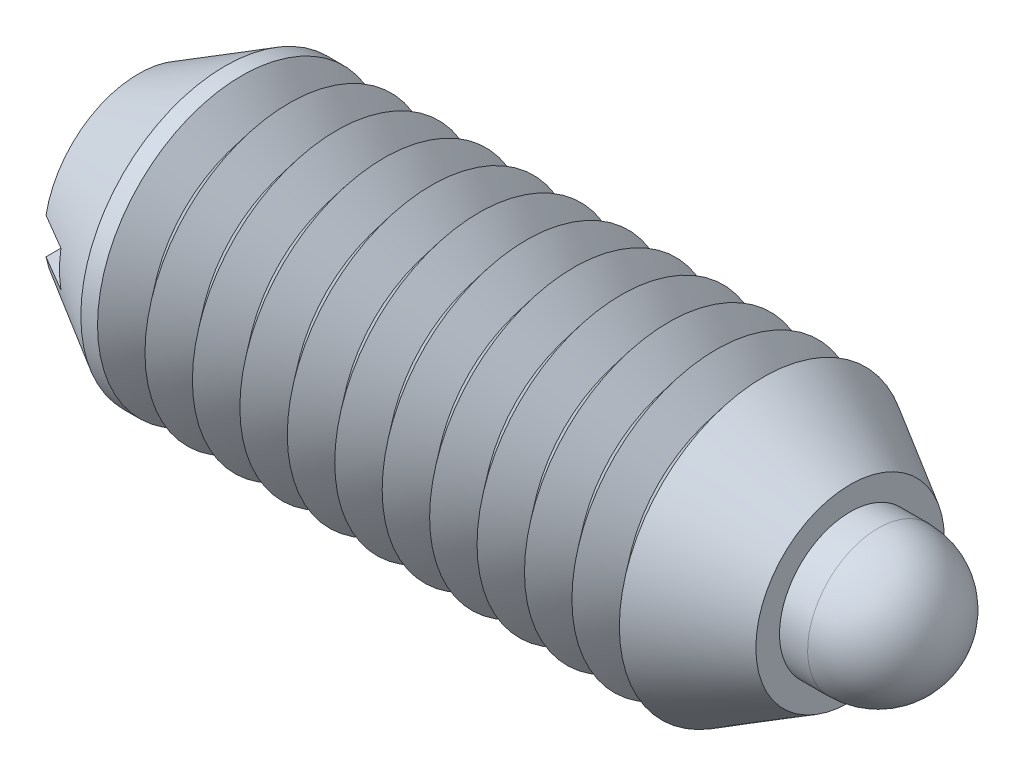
ISO-10303-21;
HEADER;
FILE_DESCRIPTION(('STEP AP214'),'2;1');
FILE_NAME('part.step','',(''),(''),'','','');
FILE_SCHEMA(('AUTOMOTIVE_DESIGN { 1 0 10303 214 1 1 1 1 }'));
ENDSEC;
DATA;
#1=APPLICATION_CONTEXT('core data for automotive mechanical design processes');
#2=APPLICATION_PROTOCOL_DEFINITION('international standard','automotive_design',2000,#1);
#3=PRODUCT_CONTEXT('',#1,'mechanical');
#4=PRODUCT('Part','Part','',(#3));
#5=PRODUCT_RELATED_PRODUCT_CATEGORY('part','',(#4));
#6=PRODUCT_DEFINITION_FORMATION('','',#4);
#7=PRODUCT_DEFINITION_CONTEXT('part definition',#1,'design');
#8=PRODUCT_DEFINITION('design','',#6,#7);
#9=PRODUCT_DEFINITION_SHAPE('','',#8);
#10=(LENGTH_UNIT() NAMED_UNIT(*) SI_UNIT(.MILLI.,.METRE.));
#11=(NAMED_UNIT(*) PLANE_ANGLE_UNIT() SI_UNIT($,.RADIAN.));
#12=(NAMED_UNIT(*) SI_UNIT($,.STERADIAN.) SOLID_ANGLE_UNIT());
#13=UNCERTAINTY_MEASURE_WITH_UNIT(LENGTH_MEASURE(1.E-05),#10,'distance_accuracy_value','');
#14=(GEOMETRIC_REPRESENTATION_CONTEXT(3) GLOBAL_UNCERTAINTY_ASSIGNED_CONTEXT((#13)) GLOBAL_UNIT_ASSIGNED_CONTEXT((#10,
#11,#12)) REPRESENTATION_CONTEXT('',''));
#15=CARTESIAN_POINT('',(0.,0.,0.));
#16=DIRECTION('',(0.,0.,1.));
#17=DIRECTION('',(1.,0.,0.));
#18=AXIS2_PLACEMENT_3D('',#15,#16,#17);
#19=CARTESIAN_POINT('',(9.18972,0.,0.));
#20=DIRECTION('',(-1.,0.,0.));
#21=DIRECTION('',(0.,-0.719424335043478,-0.694570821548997));
#22=AXIS2_PLACEMENT_3D('',#19,#20,#21);
#23=PLANE('',#22);
#24=CARTESIAN_POINT('',(9.18972,0.,0.));
#25=DIRECTION('',(1.,0.,0.));
#26=DIRECTION('',(0.,0.719424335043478,0.694570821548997));
#27=AXIS2_PLACEMENT_3D('',#24,#25,#26);
#28=CIRCLE('',#27,1.1811);
#29=CARTESIAN_POINT('',(9.18972,0.849712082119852,0.82035759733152));
#30=VERTEX_POINT('',#29);
#31=EDGE_CURVE('P0_E10',#30,#30,#28,.T.);
#32=ORIENTED_EDGE('',*,*,#31,.F.);
#33=EDGE_LOOP('',(#32));
#34=FACE_BOUND('',#33,.T.);
#35=ADVANCED_FACE('P0_F14',(#34),#23,.T.);
#36=CARTESIAN_POINT('',(9.42594,0.,0.));
#37=DIRECTION('',(1.,0.,0.));
#38=DIRECTION('',(0.,0.719424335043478,0.694570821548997));
#39=AXIS2_PLACEMENT_3D('',#36,#37,#38);
#40=CONICAL_SURFACE('',#39,1.41732,0.785398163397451);
#41=ORIENTED_EDGE('',*,*,#31,.T.);
#42=EDGE_LOOP('',(#41));
#43=FACE_BOUND('',#42,.T.);
#44=CARTESIAN_POINT('',(9.42594,0.,0.));
#45=DIRECTION('',(1.,0.,0.));
#46=DIRECTION('',(0.,0.719424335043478,0.694570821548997));
#47=AXIS2_PLACEMENT_3D('',#44,#45,#46);
#48=CIRCLE('',#47,1.41732);
#49=CARTESIAN_POINT('',(9.42594,1.01965449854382,0.984429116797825));
#50=VERTEX_POINT('',#49);
#51=EDGE_CURVE('P0_E20',#50,#50,#48,.T.);
#52=ORIENTED_EDGE('',*,*,#51,.F.);
#53=EDGE_LOOP('',(#52));
#54=FACE_BOUND('',#53,.T.);
#55=ADVANCED_FACE('P0_F54',(#43,#54),#40,.T.);
#56=CARTESIAN_POINT('',(13.55725,0.,0.));
#57=DIRECTION('',(1.,0.,0.));
#58=DIRECTION('',(0.,0.719424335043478,0.694570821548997));
#59=AXIS2_PLACEMENT_3D('',#56,#57,#58);
#60=CYLINDRICAL_SURFACE('',#59,1.41732);
#61=ORIENTED_EDGE('',*,*,#51,.T.);
#62=EDGE_LOOP('',(#61));
#63=FACE_BOUND('',#62,.T.);
#64=CARTESIAN_POINT('',(11.1427749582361,0.,0.));
#65=DIRECTION('',(1.,0.,0.));
#66=DIRECTION('',(0.,0.719424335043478,0.694570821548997));
#67=AXIS2_PLACEMENT_3D('',#64,#65,#66);
#68=CIRCLE('',#67,1.41732);
#69=CARTESIAN_POINT('',(11.1427749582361,1.01965449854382,0.984429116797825));
#70=VERTEX_POINT('',#69);
#71=EDGE_CURVE('P0_E24',#70,#70,#68,.T.);
#72=ORIENTED_EDGE('',*,*,#71,.F.);
#73=EDGE_LOOP('',(#72));
#74=FACE_BOUND('',#73,.T.);
#75=ADVANCED_FACE('P0_F50',(#63,#74),#60,.T.);
#76=CARTESIAN_POINT('',(11.55192,0.,0.));
#77=DIRECTION('',(-1.,0.,0.));
#78=DIRECTION('',(0.,-0.719424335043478,-0.694570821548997));
#79=AXIS2_PLACEMENT_3D('',#76,#77,#78);
#80=CONICAL_SURFACE('',#79,1.1811,0.523598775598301);
#81=ORIENTED_EDGE('',*,*,#71,.T.);
#82=EDGE_LOOP('',(#81));
#83=FACE_BOUND('',#82,.T.);
#84=CARTESIAN_POINT('',(11.55192,0.,0.));
#85=DIRECTION('',(1.,0.,0.));
#86=DIRECTION('',(0.,0.719424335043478,0.694570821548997));
#87=AXIS2_PLACEMENT_3D('',#84,#85,#86);
#88=CIRCLE('',#87,1.1811);
#89=CARTESIAN_POINT('',(11.55192,0.849712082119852,0.820357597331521));
#90=VERTEX_POINT('',#89);
#91=EDGE_CURVE('P0_E28',#90,#90,#88,.T.);
#92=ORIENTED_EDGE('',*,*,#91,.F.);
#93=EDGE_LOOP('',(#92));
#94=FACE_BOUND('',#93,.T.);
#95=ADVANCED_FACE('P0_F41',(#83,#94),#80,.T.);
#96=CARTESIAN_POINT('',(13.55725,0.,0.));
#97=DIRECTION('',(1.,0.,0.));
#98=DIRECTION('',(0.,0.719424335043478,0.694570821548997));
#99=AXIS2_PLACEMENT_3D('',#96,#97,#98);
#100=CYLINDRICAL_SURFACE('',#99,1.1811);
#101=ORIENTED_EDGE('',*,*,#91,.T.);
#102=EDGE_LOOP('',(#101));
#103=FACE_BOUND('',#102,.T.);
#104=CARTESIAN_POINT('',(12.37615,0.,0.));
#105=DIRECTION('',(1.,0.,0.));
#106=DIRECTION('',(0.,0.719424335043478,0.694570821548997));
#107=AXIS2_PLACEMENT_3D('',#104,#105,#106);
#108=CIRCLE('',#107,1.1811);
#109=CARTESIAN_POINT('',(12.37615,0.849712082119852,0.820357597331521));
#110=VERTEX_POINT('',#109);
#111=EDGE_CURVE('P0_E33',#110,#110,#108,.T.);
#112=ORIENTED_EDGE('',*,*,#111,.F.);
#113=EDGE_LOOP('',(#112));
#114=FACE_BOUND('',#113,.T.);
#115=ADVANCED_FACE('P0_F39',(#103,#114),#100,.T.);
#116=CARTESIAN_POINT('',(12.37615,0.,0.));
#117=DIRECTION('',(1.,0.,0.));
#118=DIRECTION('',(0.,-0.719424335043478,-0.694570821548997));
#119=AXIS2_PLACEMENT_3D('',#116,#117,#118);
#120=SPHERICAL_SURFACE('',#119,1.1811);
#121=ORIENTED_EDGE('',*,*,#111,.T.);
#122=EDGE_LOOP('',(#121));
#123=FACE_BOUND('',#122,.T.);
#124=ADVANCED_FACE('P0_F37',(#123),#120,.T.);
#125=CLOSED_SHELL('',(#35,#55,#75,#95,#115,#124));
#126=MANIFOLD_SOLID_BREP('P0_B1',#125);
#127=CARTESIAN_POINT('',(11.90625,0.,0.));
#128=DIRECTION('',(1.,0.,0.));
#129=DIRECTION('',(0.,0.,-1.));
#130=AXIS2_PLACEMENT_3D('',#127,#128,#129);
#131=PLANE('',#130);
#132=CARTESIAN_POINT('',(11.90625,0.,0.));
#133=DIRECTION('',(1.,0.,0.));
#134=DIRECTION('',(0.,0.,-1.));
#135=AXIS2_PLACEMENT_3D('',#132,#133,#134);
#136=CIRCLE('',#135,1.57711228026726);
#137=CARTESIAN_POINT('',(11.90625,0.,-1.57711228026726));
#138=VERTEX_POINT('',#137);
#139=EDGE_CURVE('P1_E81',#138,#138,#136,.T.);
#140=ORIENTED_EDGE('',*,*,#139,.T.);
#141=EDGE_LOOP('',(#140));
#142=FACE_BOUND('',#141,.T.);
#143=CARTESIAN_POINT('',(11.90625,0.,0.));
#144=DIRECTION('',(-1.,0.,0.));
#145=DIRECTION('',(0.,0.,1.));
#146=AXIS2_PLACEMENT_3D('',#143,#144,#145);
#147=CIRCLE('',#146,1.1811);
#148=CARTESIAN_POINT('',(11.90625,0.,1.1811));
#149=VERTEX_POINT('',#148);
#150=EDGE_CURVE('P1_E68',#149,#149,#147,.T.);
#151=ORIENTED_EDGE('',*,*,#150,.T.);
#152=EDGE_LOOP('',(#151));
#153=FACE_BOUND('',#152,.T.);
#154=ADVANCED_FACE('P1_F15',(#142,#153),#131,.T.);
#155=CARTESIAN_POINT('',(11.90625,0.,0.));
#156=DIRECTION('',(-1.,0.,0.));
#157=DIRECTION('',(0.,0.,1.));
#158=AXIS2_PLACEMENT_3D('',#155,#156,#157);
#159=CONICAL_SURFACE('',#158,1.57711228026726,0.523598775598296);
#160=CARTESIAN_POINT('',(10.45845,0.,0.));
#161=DIRECTION('',(-1.,0.,0.));
#162=DIRECTION('',(0.,0.,1.));
#163=AXIS2_PLACEMENT_3D('',#160,#161,#162);
#164=CIRCLE('',#163,2.413);
#165=CARTESIAN_POINT('',(10.45845,0.,2.413));
#166=VERTEX_POINT('',#165);
#167=EDGE_CURVE('P1_E187',#166,#166,#164,.T.);
#168=ORIENTED_EDGE('',*,*,#167,.F.);
#169=EDGE_LOOP('',(#168));
#170=FACE_BOUND('',#169,.T.);
#171=ORIENTED_EDGE('',*,*,#139,.F.);
#172=EDGE_LOOP('',(#171));
#173=FACE_BOUND('',#172,.T.);
#174=ADVANCED_FACE('P1_F17',(#170,#173),#159,.T.);
#175=CARTESIAN_POINT('',(0.,0.,0.));
#176=DIRECTION('',(-1.,0.,0.));
#177=DIRECTION('',(0.,0.,1.));
#178=AXIS2_PLACEMENT_3D('',#175,#176,#177);
#179=CYLINDRICAL_SURFACE('',#178,1.1811);
#180=CARTESIAN_POINT('',(11.55192,0.,0.));
#181=DIRECTION('',(-1.,0.,0.));
#182=DIRECTION('',(0.,0.,1.));
#183=AXIS2_PLACEMENT_3D('',#180,#181,#182);
#184=CIRCLE('',#183,1.1811);
#185=CARTESIAN_POINT('',(11.55192,0.,1.1811));
#186=VERTEX_POINT('',#185);
#187=EDGE_CURVE('P1_E199',#186,#186,#184,.T.);
#188=ORIENTED_EDGE('',*,*,#187,.T.);
#189=EDGE_LOOP('',(#188));
#190=FACE_BOUND('',#189,.T.);
#191=ORIENTED_EDGE('',*,*,#150,.F.);
#192=EDGE_LOOP('',(#191));
#193=FACE_BOUND('',#192,.T.);
#194=ADVANCED_FACE('P1_F504',(#190,#193),#179,.F.);
#195=CARTESIAN_POINT('',(11.55192,0.,0.));
#196=DIRECTION('',(-1.,0.,0.));
#197=DIRECTION('',(0.,0.,1.));
#198=AXIS2_PLACEMENT_3D('',#195,#196,#197);
#199=CONICAL_SURFACE('',#198,1.1811,0.785398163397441);
#200=CARTESIAN_POINT('',(11.3157,0.,0.));
#201=DIRECTION('',(-1.,0.,0.));
#202=DIRECTION('',(0.,0.,1.));
#203=AXIS2_PLACEMENT_3D('',#200,#201,#202);
#204=CIRCLE('',#203,1.41732);
#205=CARTESIAN_POINT('',(11.3157,0.,1.41732));
#206=VERTEX_POINT('',#205);
#207=EDGE_CURVE('P1_E196',#206,#206,#204,.T.);
#208=ORIENTED_EDGE('',*,*,#207,.T.);
#209=EDGE_LOOP('',(#208));
#210=FACE_BOUND('',#209,.T.);
#211=ORIENTED_EDGE('',*,*,#187,.F.);
#212=EDGE_LOOP('',(#211));
#213=FACE_BOUND('',#212,.T.);
#214=ADVANCED_FACE('P1_F494',(#210,#213),#199,.F.);
#215=CARTESIAN_POINT('',(0.,0.,0.));
#216=DIRECTION('',(-1.,0.,0.));
#217=DIRECTION('',(0.,0.,1.));
#218=AXIS2_PLACEMENT_3D('',#215,#216,#217);
#219=CYLINDRICAL_SURFACE('',#218,1.41732);
#220=CARTESIAN_POINT('',(1.80975,0.,0.));
#221=DIRECTION('',(-1.,0.,0.));
#222=DIRECTION('',(0.,0.,1.));
#223=AXIS2_PLACEMENT_3D('',#220,#221,#222);
#224=CIRCLE('',#223,1.41732);
#225=CARTESIAN_POINT('',(1.80975,0.,1.41732));
#226=VERTEX_POINT('',#225);
#227=EDGE_CURVE('P1_E193',#226,#226,#224,.T.);
#228=ORIENTED_EDGE('',*,*,#227,.T.);
#229=EDGE_LOOP('',(#228));
#230=FACE_BOUND('',#229,.T.);
#231=ORIENTED_EDGE('',*,*,#207,.F.);
#232=EDGE_LOOP('',(#231));
#233=FACE_BOUND('',#232,.T.);
#234=ADVANCED_FACE('P1_F484',(#230,#233),#219,.F.);
#235=CARTESIAN_POINT('',(1.80975,0.,0.));
#236=DIRECTION('',(1.,0.,0.));
#237=DIRECTION('',(0.,0.,-1.));
#238=AXIS2_PLACEMENT_3D('',#235,#236,#237);
#239=PLANE('',#238);
#240=ORIENTED_EDGE('',*,*,#227,.F.);
#241=EDGE_LOOP('',(#240));
#242=FACE_BOUND('',#241,.T.);
#243=ADVANCED_FACE('P1_F474',(#242),#239,.T.);
#244=CARTESIAN_POINT('',(10.061575,0.,0.));
#245=DIRECTION('',(1.,0.,0.));
#246=DIRECTION('',(0.,0.,-1.));
#247=AXIS2_PLACEMENT_3D('',#244,#245,#246);
#248=CONICAL_SURFACE('',#247,1.91730328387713,0.895664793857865);
#249=ORIENTED_EDGE('',*,*,#167,.T.);
#250=EDGE_LOOP('',(#249));
#251=FACE_BOUND('',#250,.T.);
#252=CARTESIAN_POINT('',(10.061575,0.,0.));
#253=DIRECTION('',(-1.,0.,0.));
#254=DIRECTION('',(0.,0.,1.));
#255=AXIS2_PLACEMENT_3D('',#252,#253,#254);
#256=CIRCLE('',#255,1.91730328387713);
#257=CARTESIAN_POINT('',(10.061575,0.,1.91730328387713));
#258=VERTEX_POINT('',#257);
#259=EDGE_CURVE('P1_E190',#258,#258,#256,.T.);
#260=ORIENTED_EDGE('',*,*,#259,.F.);
#261=EDGE_LOOP('',(#260));
#262=FACE_BOUND('',#261,.T.);
#263=ADVANCED_FACE('P1_F464',(#251,#262),#248,.T.);
#264=CARTESIAN_POINT('',(9.66469999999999,0.,0.));
#265=DIRECTION('',(-1.,0.,0.));
#266=DIRECTION('',(0.,0.,1.));
#267=AXIS2_PLACEMENT_3D('',#264,#265,#266);
#268=CONICAL_SURFACE('',#267,2.413,0.895664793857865);
#269=ORIENTED_EDGE('',*,*,#259,.T.);
#270=EDGE_LOOP('',(#269));
#271=FACE_BOUND('',#270,.T.);
#272=CARTESIAN_POINT('',(9.66469999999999,0.,0.));
#273=DIRECTION('',(-1.,0.,0.));
#274=DIRECTION('',(0.,0.,1.));
#275=AXIS2_PLACEMENT_3D('',#272,#273,#274);
#276=CIRCLE('',#275,2.413);
#277=CARTESIAN_POINT('',(9.66469999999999,0.,2.413));
#278=VERTEX_POINT('',#277);
#279=EDGE_CURVE('P1_E181',#278,#278,#276,.T.);
#280=ORIENTED_EDGE('',*,*,#279,.F.);
#281=EDGE_LOOP('',(#280));
#282=FACE_BOUND('',#281,.T.);
#283=ADVANCED_FACE('P1_F454',(#271,#282),#268,.T.);
#284=CARTESIAN_POINT('',(9.26782499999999,0.,0.));
#285=DIRECTION('',(1.,0.,0.));
#286=DIRECTION('',(0.,0.,-1.));
#287=AXIS2_PLACEMENT_3D('',#284,#285,#286);
#288=CONICAL_SURFACE('',#287,1.91730328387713,0.895664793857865);
#289=ORIENTED_EDGE('',*,*,#279,.T.);
#290=EDGE_LOOP('',(#289));
#291=FACE_BOUND('',#290,.T.);
#292=CARTESIAN_POINT('',(9.26782499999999,0.,0.));
#293=DIRECTION('',(-1.,0.,0.));
#294=DIRECTION('',(0.,0.,1.));
#295=AXIS2_PLACEMENT_3D('',#292,#293,#294);
#296=CIRCLE('',#295,1.91730328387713);
#297=CARTESIAN_POINT('',(9.26782499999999,0.,1.91730328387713));
#298=VERTEX_POINT('',#297);
#299=EDGE_CURVE('P1_E184',#298,#298,#296,.T.);
#300=ORIENTED_EDGE('',*,*,#299,.F.);
#301=EDGE_LOOP('',(#300));
#302=FACE_BOUND('',#301,.T.);
#303=ADVANCED_FACE('P1_F444',(#291,#302),#288,.T.);
#304=CARTESIAN_POINT('',(8.87094999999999,0.,0.));
#305=DIRECTION('',(-1.,0.,0.));
#306=DIRECTION('',(0.,0.,1.));
#307=AXIS2_PLACEMENT_3D('',#304,#305,#306);
#308=CONICAL_SURFACE('',#307,2.413,0.895664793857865);
#309=ORIENTED_EDGE('',*,*,#299,.T.);
#310=EDGE_LOOP('',(#309));
#311=FACE_BOUND('',#310,.T.);
#312=CARTESIAN_POINT('',(8.87094999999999,0.,0.));
#313=DIRECTION('',(-1.,0.,0.));
#314=DIRECTION('',(0.,0.,1.));
#315=AXIS2_PLACEMENT_3D('',#312,#313,#314);
#316=CIRCLE('',#315,2.413);
#317=CARTESIAN_POINT('',(8.87094999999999,0.,2.413));
#318=VERTEX_POINT('',#317);
#319=EDGE_CURVE('P1_E175',#318,#318,#316,.T.);
#320=ORIENTED_EDGE('',*,*,#319,.F.);
#321=EDGE_LOOP('',(#320));
#322=FACE_BOUND('',#321,.T.);
#323=ADVANCED_FACE('P1_F434',(#311,#322),#308,.T.);
#324=CARTESIAN_POINT('',(8.47407499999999,0.,0.));
#325=DIRECTION('',(1.,0.,0.));
#326=DIRECTION('',(0.,0.,-1.));
#327=AXIS2_PLACEMENT_3D('',#324,#325,#326);
#328=CONICAL_SURFACE('',#327,1.91730328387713,0.895664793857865);
#329=ORIENTED_EDGE('',*,*,#319,.T.);
#330=EDGE_LOOP('',(#329));
#331=FACE_BOUND('',#330,.T.);
#332=CARTESIAN_POINT('',(8.47407499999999,0.,0.));
#333=DIRECTION('',(-1.,0.,0.));
#334=DIRECTION('',(0.,0.,1.));
#335=AXIS2_PLACEMENT_3D('',#332,#333,#334);
#336=CIRCLE('',#335,1.91730328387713);
#337=CARTESIAN_POINT('',(8.47407499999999,0.,1.91730328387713));
#338=VERTEX_POINT('',#337);
#339=EDGE_CURVE('P1_E178',#338,#338,#336,.T.);
#340=ORIENTED_EDGE('',*,*,#339,.F.);
#341=EDGE_LOOP('',(#340));
#342=FACE_BOUND('',#341,.T.);
#343=ADVANCED_FACE('P1_F424',(#331,#342),#328,.T.);
#344=CARTESIAN_POINT('',(8.07719999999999,0.,0.));
#345=DIRECTION('',(-1.,0.,0.));
#346=DIRECTION('',(0.,0.,1.));
#347=AXIS2_PLACEMENT_3D('',#344,#345,#346);
#348=CONICAL_SURFACE('',#347,2.413,0.895664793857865);
#349=ORIENTED_EDGE('',*,*,#339,.T.);
#350=EDGE_LOOP('',(#349));
#351=FACE_BOUND('',#350,.T.);
#352=CARTESIAN_POINT('',(8.07719999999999,0.,0.));
#353=DIRECTION('',(-1.,0.,0.));
#354=DIRECTION('',(0.,0.,1.));
#355=AXIS2_PLACEMENT_3D('',#352,#353,#354);
#356=CIRCLE('',#355,2.413);
#357=CARTESIAN_POINT('',(8.07719999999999,0.,2.413));
#358=VERTEX_POINT('',#357);
#359=EDGE_CURVE('P1_E169',#358,#358,#356,.T.);
#360=ORIENTED_EDGE('',*,*,#359,.F.);
#361=EDGE_LOOP('',(#360));
#362=FACE_BOUND('',#361,.T.);
#363=ADVANCED_FACE('P1_F414',(#351,#362),#348,.T.);
#364=CARTESIAN_POINT('',(7.68032499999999,0.,0.));
#365=DIRECTION('',(1.,0.,0.));
#366=DIRECTION('',(0.,0.,-1.));
#367=AXIS2_PLACEMENT_3D('',#364,#365,#366);
#368=CONICAL_SURFACE('',#367,1.91730328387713,0.895664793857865);
#369=ORIENTED_EDGE('',*,*,#359,.T.);
#370=EDGE_LOOP('',(#369));
#371=FACE_BOUND('',#370,.T.);
#372=CARTESIAN_POINT('',(7.68032499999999,0.,0.));
#373=DIRECTION('',(-1.,0.,0.));
#374=DIRECTION('',(0.,0.,1.));
#375=AXIS2_PLACEMENT_3D('',#372,#373,#374);
#376=CIRCLE('',#375,1.91730328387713);
#377=CARTESIAN_POINT('',(7.68032499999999,0.,1.91730328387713));
#378=VERTEX_POINT('',#377);
#379=EDGE_CURVE('P1_E172',#378,#378,#376,.T.);
#380=ORIENTED_EDGE('',*,*,#379,.F.);
#381=EDGE_LOOP('',(#380));
#382=FACE_BOUND('',#381,.T.);
#383=ADVANCED_FACE('P1_F404',(#371,#382),#368,.T.);
#384=CARTESIAN_POINT('',(7.28344999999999,0.,0.));
#385=DIRECTION('',(-1.,0.,0.));
#386=DIRECTION('',(0.,0.,1.));
#387=AXIS2_PLACEMENT_3D('',#384,#385,#386);
#388=CONICAL_SURFACE('',#387,2.413,0.895664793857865);
#389=ORIENTED_EDGE('',*,*,#379,.T.);
#390=EDGE_LOOP('',(#389));
#391=FACE_BOUND('',#390,.T.);
#392=CARTESIAN_POINT('',(7.28344999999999,0.,0.));
#393=DIRECTION('',(-1.,0.,0.));
#394=DIRECTION('',(0.,0.,1.));
#395=AXIS2_PLACEMENT_3D('',#392,#393,#394);
#396=CIRCLE('',#395,2.413);
#397=CARTESIAN_POINT('',(7.28344999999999,0.,2.413));
#398=VERTEX_POINT('',#397);
#399=EDGE_CURVE('P1_E163',#398,#398,#396,.T.);
#400=ORIENTED_EDGE('',*,*,#399,.F.);
#401=EDGE_LOOP('',(#400));
#402=FACE_BOUND('',#401,.T.);
#403=ADVANCED_FACE('P1_F394',(#391,#402),#388,.T.);
#404=CARTESIAN_POINT('',(6.88657499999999,0.,0.));
#405=DIRECTION('',(1.,0.,0.));
#406=DIRECTION('',(0.,0.,-1.));
#407=AXIS2_PLACEMENT_3D('',#404,#405,#406);
#408=CONICAL_SURFACE('',#407,1.91730328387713,0.895664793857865);
#409=ORIENTED_EDGE('',*,*,#399,.T.);
#410=EDGE_LOOP('',(#409));
#411=FACE_BOUND('',#410,.T.);
#412=CARTESIAN_POINT('',(6.88657499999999,0.,0.));
#413=DIRECTION('',(-1.,0.,0.));
#414=DIRECTION('',(0.,0.,1.));
#415=AXIS2_PLACEMENT_3D('',#412,#413,#414);
#416=CIRCLE('',#415,1.91730328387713);
#417=CARTESIAN_POINT('',(6.88657499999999,0.,1.91730328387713));
#418=VERTEX_POINT('',#417);
#419=EDGE_CURVE('P1_E166',#418,#418,#416,.T.);
#420=ORIENTED_EDGE('',*,*,#419,.F.);
#421=EDGE_LOOP('',(#420));
#422=FACE_BOUND('',#421,.T.);
#423=ADVANCED_FACE('P1_F384',(#411,#422),#408,.T.);
#424=CARTESIAN_POINT('',(6.48969999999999,0.,0.));
#425=DIRECTION('',(-1.,0.,0.));
#426=DIRECTION('',(0.,0.,1.));
#427=AXIS2_PLACEMENT_3D('',#424,#425,#426);
#428=CONICAL_SURFACE('',#427,2.413,0.895664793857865);
#429=ORIENTED_EDGE('',*,*,#419,.T.);
#430=EDGE_LOOP('',(#429));
#431=FACE_BOUND('',#430,.T.);
#432=CARTESIAN_POINT('',(6.48969999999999,0.,0.));
#433=DIRECTION('',(-1.,0.,0.));
#434=DIRECTION('',(0.,0.,1.));
#435=AXIS2_PLACEMENT_3D('',#432,#433,#434);
#436=CIRCLE('',#435,2.413);
#437=CARTESIAN_POINT('',(6.48969999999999,0.,2.413));
#438=VERTEX_POINT('',#437);
#439=EDGE_CURVE('P1_E157',#438,#438,#436,.T.);
#440=ORIENTED_EDGE('',*,*,#439,.F.);
#441=EDGE_LOOP('',(#440));
#442=FACE_BOUND('',#441,.T.);
#443=ADVANCED_FACE('P1_F374',(#431,#442),#428,.T.);
#444=CARTESIAN_POINT('',(6.09282499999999,0.,0.));
#445=DIRECTION('',(1.,0.,0.));
#446=DIRECTION('',(0.,0.,-1.));
#447=AXIS2_PLACEMENT_3D('',#444,#445,#446);
#448=CONICAL_SURFACE('',#447,1.91730328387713,0.895664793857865);
#449=ORIENTED_EDGE('',*,*,#439,.T.);
#450=EDGE_LOOP('',(#449));
#451=FACE_BOUND('',#450,.T.);
#452=CARTESIAN_POINT('',(6.09282499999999,0.,0.));
#453=DIRECTION('',(-1.,0.,0.));
#454=DIRECTION('',(0.,0.,1.));
#455=AXIS2_PLACEMENT_3D('',#452,#453,#454);
#456=CIRCLE('',#455,1.91730328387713);
#457=CARTESIAN_POINT('',(6.09282499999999,0.,1.91730328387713));
#458=VERTEX_POINT('',#457);
#459=EDGE_CURVE('P1_E160',#458,#458,#456,.T.);
#460=ORIENTED_EDGE('',*,*,#459,.F.);
#461=EDGE_LOOP('',(#460));
#462=FACE_BOUND('',#461,.T.);
#463=ADVANCED_FACE('P1_F364',(#451,#462),#448,.T.);
#464=CARTESIAN_POINT('',(5.69594999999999,0.,0.));
#465=DIRECTION('',(-1.,0.,0.));
#466=DIRECTION('',(0.,0.,1.));
#467=AXIS2_PLACEMENT_3D('',#464,#465,#466);
#468=CONICAL_SURFACE('',#467,2.413,0.895664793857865);
#469=ORIENTED_EDGE('',*,*,#459,.T.);
#470=EDGE_LOOP('',(#469));
#471=FACE_BOUND('',#470,.T.);
#472=CARTESIAN_POINT('',(5.69594999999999,0.,0.));
#473=DIRECTION('',(-1.,0.,0.));
#474=DIRECTION('',(0.,0.,1.));
#475=AXIS2_PLACEMENT_3D('',#472,#473,#474);
#476=CIRCLE('',#475,2.413);
#477=CARTESIAN_POINT('',(5.69594999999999,0.,2.413));
#478=VERTEX_POINT('',#477);
#479=EDGE_CURVE('P1_E151',#478,#478,#476,.T.);
#480=ORIENTED_EDGE('',*,*,#479,.F.);
#481=EDGE_LOOP('',(#480));
#482=FACE_BOUND('',#481,.T.);
#483=ADVANCED_FACE('P1_F354',(#471,#482),#468,.T.);
#484=CARTESIAN_POINT('',(5.29907499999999,0.,0.));
#485=DIRECTION('',(1.,0.,0.));
#486=DIRECTION('',(0.,0.,-1.));
#487=AXIS2_PLACEMENT_3D('',#484,#485,#486);
#488=CONICAL_SURFACE('',#487,1.91730328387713,0.895664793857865);
#489=ORIENTED_EDGE('',*,*,#479,.T.);
#490=EDGE_LOOP('',(#489));
#491=FACE_BOUND('',#490,.T.);
#492=CARTESIAN_POINT('',(5.29907499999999,0.,0.));
#493=DIRECTION('',(-1.,0.,0.));
#494=DIRECTION('',(0.,0.,1.));
#495=AXIS2_PLACEMENT_3D('',#492,#493,#494);
#496=CIRCLE('',#495,1.91730328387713);
#497=CARTESIAN_POINT('',(5.29907499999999,0.,1.91730328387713));
#498=VERTEX_POINT('',#497);
#499=EDGE_CURVE('P1_E154',#498,#498,#496,.T.);
#500=ORIENTED_EDGE('',*,*,#499,.F.);
#501=EDGE_LOOP('',(#500));
#502=FACE_BOUND('',#501,.T.);
#503=ADVANCED_FACE('P1_F344',(#491,#502),#488,.T.);
#504=CARTESIAN_POINT('',(4.90219999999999,0.,0.));
#505=DIRECTION('',(-1.,0.,0.));
#506=DIRECTION('',(0.,0.,1.));
#507=AXIS2_PLACEMENT_3D('',#504,#505,#506);
#508=CONICAL_SURFACE('',#507,2.413,0.895664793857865);
#509=ORIENTED_EDGE('',*,*,#499,.T.);
#510=EDGE_LOOP('',(#509));
#511=FACE_BOUND('',#510,.T.);
#512=CARTESIAN_POINT('',(4.90219999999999,0.,0.));
#513=DIRECTION('',(-1.,0.,0.));
#514=DIRECTION('',(0.,0.,1.));
#515=AXIS2_PLACEMENT_3D('',#512,#513,#514);
#516=CIRCLE('',#515,2.413);
#517=CARTESIAN_POINT('',(4.90219999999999,0.,2.413));
#518=VERTEX_POINT('',#517);
#519=EDGE_CURVE('P1_E145',#518,#518,#516,.T.);
#520=ORIENTED_EDGE('',*,*,#519,.F.);
#521=EDGE_LOOP('',(#520));
#522=FACE_BOUND('',#521,.T.);
#523=ADVANCED_FACE('P1_F334',(#511,#522),#508,.T.);
#524=CARTESIAN_POINT('',(4.50532499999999,0.,0.));
#525=DIRECTION('',(1.,0.,0.));
#526=DIRECTION('',(0.,0.,-1.));
#527=AXIS2_PLACEMENT_3D('',#524,#525,#526);
#528=CONICAL_SURFACE('',#527,1.91730328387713,0.895664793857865);
#529=ORIENTED_EDGE('',*,*,#519,.T.);
#530=EDGE_LOOP('',(#529));
#531=FACE_BOUND('',#530,.T.);
#532=CARTESIAN_POINT('',(4.50532499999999,0.,0.));
#533=DIRECTION('',(-1.,0.,0.));
#534=DIRECTION('',(0.,0.,1.));
#535=AXIS2_PLACEMENT_3D('',#532,#533,#534);
#536=CIRCLE('',#535,1.91730328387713);
#537=CARTESIAN_POINT('',(4.50532499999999,0.,1.91730328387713));
#538=VERTEX_POINT('',#537);
#539=EDGE_CURVE('P1_E148',#538,#538,#536,.T.);
#540=ORIENTED_EDGE('',*,*,#539,.F.);
#541=EDGE_LOOP('',(#540));
#542=FACE_BOUND('',#541,.T.);
#543=ADVANCED_FACE('P1_F324',(#531,#542),#528,.T.);
#544=CARTESIAN_POINT('',(4.10844999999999,0.,0.));
#545=DIRECTION('',(-1.,0.,0.));
#546=DIRECTION('',(0.,0.,1.));
#547=AXIS2_PLACEMENT_3D('',#544,#545,#546);
#548=CONICAL_SURFACE('',#547,2.413,0.895664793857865);
#549=ORIENTED_EDGE('',*,*,#539,.T.);
#550=EDGE_LOOP('',(#549));
#551=FACE_BOUND('',#550,.T.);
#552=CARTESIAN_POINT('',(4.10844999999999,0.,0.));
#553=DIRECTION('',(-1.,0.,0.));
#554=DIRECTION('',(0.,0.,1.));
#555=AXIS2_PLACEMENT_3D('',#552,#553,#554);
#556=CIRCLE('',#555,2.413);
#557=CARTESIAN_POINT('',(4.10844999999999,0.,2.413));
#558=VERTEX_POINT('',#557);
#559=EDGE_CURVE('P1_E139',#558,#558,#556,.T.);
#560=ORIENTED_EDGE('',*,*,#559,.F.);
#561=EDGE_LOOP('',(#560));
#562=FACE_BOUND('',#561,.T.);
#563=ADVANCED_FACE('P1_F314',(#551,#562),#548,.T.);
#564=CARTESIAN_POINT('',(3.71157499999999,0.,0.));
#565=DIRECTION('',(1.,0.,0.));
#566=DIRECTION('',(0.,0.,-1.));
#567=AXIS2_PLACEMENT_3D('',#564,#565,#566);
#568=CONICAL_SURFACE('',#567,1.91730328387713,0.895664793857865);
#569=ORIENTED_EDGE('',*,*,#559,.T.);
#570=EDGE_LOOP('',(#569));
#571=FACE_BOUND('',#570,.T.);
#572=CARTESIAN_POINT('',(3.71157499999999,0.,0.));
#573=DIRECTION('',(-1.,0.,0.));
#574=DIRECTION('',(0.,0.,1.));
#575=AXIS2_PLACEMENT_3D('',#572,#573,#574);
#576=CIRCLE('',#575,1.91730328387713);
#577=CARTESIAN_POINT('',(3.71157499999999,0.,1.91730328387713));
#578=VERTEX_POINT('',#577);
#579=EDGE_CURVE('P1_E142',#578,#578,#576,.T.);
#580=ORIENTED_EDGE('',*,*,#579,.F.);
#581=EDGE_LOOP('',(#580));
#582=FACE_BOUND('',#581,.T.);
#583=ADVANCED_FACE('P1_F304',(#571,#582),#568,.T.);
#584=CARTESIAN_POINT('',(3.31469999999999,0.,0.));
#585=DIRECTION('',(-1.,0.,0.));
#586=DIRECTION('',(0.,0.,1.));
#587=AXIS2_PLACEMENT_3D('',#584,#585,#586);
#588=CONICAL_SURFACE('',#587,2.413,0.895664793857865);
#589=ORIENTED_EDGE('',*,*,#579,.T.);
#590=EDGE_LOOP('',(#589));
#591=FACE_BOUND('',#590,.T.);
#592=CARTESIAN_POINT('',(3.31469999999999,0.,0.));
#593=DIRECTION('',(-1.,0.,0.));
#594=DIRECTION('',(0.,0.,1.));
#595=AXIS2_PLACEMENT_3D('',#592,#593,#594);
#596=CIRCLE('',#595,2.413);
#597=CARTESIAN_POINT('',(3.31469999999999,0.,2.413));
#598=VERTEX_POINT('',#597);
#599=EDGE_CURVE('P1_E129',#598,#598,#596,.T.);
#600=ORIENTED_EDGE('',*,*,#599,.F.);
#601=EDGE_LOOP('',(#600));
#602=FACE_BOUND('',#601,.T.);
#603=ADVANCED_FACE('P1_F294',(#591,#602),#588,.T.);
#604=CARTESIAN_POINT('',(2.91782499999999,0.,0.));
#605=DIRECTION('',(1.,0.,0.));
#606=DIRECTION('',(0.,0.,-1.));
#607=AXIS2_PLACEMENT_3D('',#604,#605,#606);
#608=CONICAL_SURFACE('',#607,1.91730328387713,0.895664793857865);
#609=ORIENTED_EDGE('',*,*,#599,.T.);
#610=EDGE_LOOP('',(#609));
#611=FACE_BOUND('',#610,.T.);
#612=CARTESIAN_POINT('',(2.91782499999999,0.,0.));
#613=DIRECTION('',(-1.,0.,0.));
#614=DIRECTION('',(0.,0.,1.));
#615=AXIS2_PLACEMENT_3D('',#612,#613,#614);
#616=CIRCLE('',#615,1.91730328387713);
#617=CARTESIAN_POINT('',(2.91782499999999,0.,1.91730328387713));
#618=VERTEX_POINT('',#617);
#619=EDGE_CURVE('P1_E136',#618,#618,#616,.T.);
#620=ORIENTED_EDGE('',*,*,#619,.F.);
#621=EDGE_LOOP('',(#620));
#622=FACE_BOUND('',#621,.T.);
#623=ADVANCED_FACE('P1_F284',(#611,#622),#608,.T.);
#624=CARTESIAN_POINT('',(2.52094999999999,0.,0.));
#625=DIRECTION('',(-1.,0.,0.));
#626=DIRECTION('',(0.,0.,1.));
#627=AXIS2_PLACEMENT_3D('',#624,#625,#626);
#628=CONICAL_SURFACE('',#627,2.413,0.895664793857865);
#629=ORIENTED_EDGE('',*,*,#619,.T.);
#630=EDGE_LOOP('',(#629));
#631=FACE_BOUND('',#630,.T.);
#632=CARTESIAN_POINT('',(2.52094999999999,0.,0.));
#633=DIRECTION('',(-1.,0.,0.));
#634=DIRECTION('',(0.,0.,1.));
#635=AXIS2_PLACEMENT_3D('',#632,#633,#634);
#636=CIRCLE('',#635,2.413);
#637=CARTESIAN_POINT('',(2.52094999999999,0.,2.413));
#638=VERTEX_POINT('',#637);
#639=EDGE_CURVE('P1_E126',#638,#638,#636,.T.);
#640=ORIENTED_EDGE('',*,*,#639,.F.);
#641=EDGE_LOOP('',(#640));
#642=FACE_BOUND('',#641,.T.);
#643=ADVANCED_FACE('P1_F274',(#631,#642),#628,.T.);
#644=CARTESIAN_POINT('',(2.12407499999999,0.,0.));
#645=DIRECTION('',(1.,0.,0.));
#646=DIRECTION('',(0.,0.,-1.));
#647=AXIS2_PLACEMENT_3D('',#644,#645,#646);
#648=CONICAL_SURFACE('',#647,1.91730328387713,0.895664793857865);
#649=ORIENTED_EDGE('',*,*,#639,.T.);
#650=EDGE_LOOP('',(#649));
#651=FACE_BOUND('',#650,.T.);
#652=CARTESIAN_POINT('',(2.12407499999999,0.,0.));
#653=DIRECTION('',(-1.,0.,0.));
#654=DIRECTION('',(0.,0.,1.));
#655=AXIS2_PLACEMENT_3D('',#652,#653,#654);
#656=CIRCLE('',#655,1.91730328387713);
#657=CARTESIAN_POINT('',(2.12407499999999,0.,1.91730328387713));
#658=VERTEX_POINT('',#657);
#659=EDGE_CURVE('P1_E125',#658,#658,#656,.T.);
#660=ORIENTED_EDGE('',*,*,#659,.F.);
#661=EDGE_LOOP('',(#660));
#662=FACE_BOUND('',#661,.T.);
#663=ADVANCED_FACE('P1_F264',(#651,#662),#648,.T.);
#664=CARTESIAN_POINT('',(1.72719999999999,0.,0.));
#665=DIRECTION('',(-1.,0.,0.));
#666=DIRECTION('',(0.,0.,1.));
#667=AXIS2_PLACEMENT_3D('',#664,#665,#666);
#668=CONICAL_SURFACE('',#667,2.413,0.895664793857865);
#669=ORIENTED_EDGE('',*,*,#659,.T.);
#670=EDGE_LOOP('',(#669));
#671=FACE_BOUND('',#670,.T.);
#672=CARTESIAN_POINT('',(1.72719999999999,0.,0.));
#673=DIRECTION('',(-1.,0.,0.));
#674=DIRECTION('',(0.,0.,1.));
#675=AXIS2_PLACEMENT_3D('',#672,#673,#674);
#676=CIRCLE('',#675,2.413);
#677=CARTESIAN_POINT('',(1.72719999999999,0.,2.413));
#678=VERTEX_POINT('',#677);
#679=EDGE_CURVE('P1_E123',#678,#678,#676,.T.);
#680=ORIENTED_EDGE('',*,*,#679,.F.);
#681=EDGE_LOOP('',(#680));
#682=FACE_BOUND('',#681,.T.);
#683=ADVANCED_FACE('P1_F110',(#671,#682),#668,.T.);
#684=CARTESIAN_POINT('',(0.,0.,0.));
#685=DIRECTION('',(1.,0.,0.));
#686=DIRECTION('',(0.,0.,-1.));
#687=AXIS2_PLACEMENT_3D('',#684,#685,#686);
#688=PLANE('',#687);
#689=CARTESIAN_POINT('',(0.,0.,0.));
#690=DIRECTION('',(1.,0.,0.));
#691=DIRECTION('',(0.,0.,-1.));
#692=AXIS2_PLACEMENT_3D('',#689,#690,#691);
#693=CIRCLE('',#692,1.57711228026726);
#694=CARTESIAN_POINT('',(0.,-0.301625,-1.54800048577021));
#695=VERTEX_POINT('',#694);
#696=CARTESIAN_POINT('',(0.,-0.301625,1.54800048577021));
#697=VERTEX_POINT('',#696);
#698=EDGE_CURVE('P1_E77',#695,#697,#693,.F.);
#699=ORIENTED_EDGE('',*,*,#698,.T.);
#700=DIRECTION('',(0.,0.,1.));
#701=VECTOR('',#700,1.);
#702=CARTESIAN_POINT('',(0.,-0.301625,-2.413));
#703=LINE('',#702,#701);
#704=EDGE_CURVE('P1_E35',#695,#697,#703,.T.);
#705=ORIENTED_EDGE('',*,*,#704,.F.);
#706=EDGE_LOOP('',(#699,#705));
#707=FACE_BOUND('',#706,.T.);
#708=ADVANCED_FACE('P1_F101',(#707),#688,.F.);
#709=CARTESIAN_POINT('',(0.,-0.301625,-2.413));
#710=DIRECTION('',(0.,-1.,0.));
#711=DIRECTION('',(0.,0.,-1.));
#712=AXIS2_PLACEMENT_3D('',#709,#710,#711);
#713=PLANE('',#712);
#714=CARTESIAN_POINT('',(3.52158419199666,-0.301625,-3.59767806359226));
#715=CARTESIAN_POINT('',(3.34576119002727,-0.301625,-3.49580919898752));
#716=CARTESIAN_POINT('',(3.1699501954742,-0.301625,-3.3939195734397));
#717=CARTESIAN_POINT('',(2.8183625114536,-0.301625,-3.19008072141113));
#718=CARTESIAN_POINT('',(2.64258582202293,-0.301625,-3.08813149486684));
#719=CARTESIAN_POINT('',(2.11525421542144,-0.301625,-2.78212758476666));
#720=CARTESIAN_POINT('',(1.7637667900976,-0.301625,-2.57795664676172));
#721=CARTESIAN_POINT('',(1.07028339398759,-0.301625,-2.17437275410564));
#722=CARTESIAN_POINT('',(0.728278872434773,-0.301625,-1.97497452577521));
#723=CARTESIAN_POINT('',(0.215888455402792,-0.301625,-1.674891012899));
#724=CARTESIAN_POINT('',(0.0452088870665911,-0.301625,-1.57470738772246));
#725=CARTESIAN_POINT('',(-0.295805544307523,-0.301625,-1.37375586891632));
#726=CARTESIAN_POINT('',(-0.466140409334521,-0.301625,-1.27298797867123));
#727=CARTESIAN_POINT('',(-0.72159216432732,-0.301625,-1.12068789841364));
#728=CARTESIAN_POINT('',(-0.806966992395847,-0.301625,-1.06958894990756));
#729=CARTESIAN_POINT('',(-0.977473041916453,-0.301625,-0.966920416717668));
#730=CARTESIAN_POINT('',(-1.06260417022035,-0.301625,-0.915350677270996));
#731=CARTESIAN_POINT('',(-1.23331135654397,-0.301625,-0.8109603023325));
#732=CARTESIAN_POINT('',(-1.31888290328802,-0.301625,-0.758132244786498));
#733=CARTESIAN_POINT('',(-1.44658022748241,-0.301625,-0.677929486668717));
#734=CARTESIAN_POINT('',(-1.48901559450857,-0.301625,-0.651048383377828));
#735=CARTESIAN_POINT('',(-1.5735852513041,-0.301625,-0.596818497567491));
#736=CARTESIAN_POINT('',(-1.61571955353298,-0.301625,-0.569469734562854));
#737=CARTESIAN_POINT('',(-1.69957056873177,-0.301625,-0.514061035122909));
#738=CARTESIAN_POINT('',(-1.7412868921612,-0.301625,-0.486000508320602));
#739=CARTESIAN_POINT('',(-1.82410813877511,-0.301625,-0.428735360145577));
#740=CARTESIAN_POINT('',(-1.86521107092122,-0.301625,-0.399527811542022));
#741=CARTESIAN_POINT('',(-1.92563905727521,-0.301625,-0.354477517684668));
#742=CARTESIAN_POINT('',(-1.9454820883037,-0.301625,-0.339332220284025));
#743=CARTESIAN_POINT('',(-1.98467245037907,-0.301625,-0.308416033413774));
#744=CARTESIAN_POINT('',(-2.00401989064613,-0.301625,-0.292645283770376));
#745=CARTESIAN_POINT('',(-2.04188576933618,-0.301625,-0.26028942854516));
#746=CARTESIAN_POINT('',(-2.06040735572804,-0.301625,-0.24370803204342));
#747=CARTESIAN_POINT('',(-2.09622171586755,-0.301625,-0.209281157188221));
#748=CARTESIAN_POINT('',(-2.11351640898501,-0.301625,-0.191437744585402));
#749=CARTESIAN_POINT('',(-2.14133100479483,-0.301625,-0.159102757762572));
#750=CARTESIAN_POINT('',(-2.15238809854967,-0.301625,-0.145080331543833));
#751=CARTESIAN_POINT('',(-2.17256921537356,-0.301625,-0.115713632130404));
#752=CARTESIAN_POINT('',(-2.18170056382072,-0.301625,-0.100374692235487));
#753=CARTESIAN_POINT('',(-2.19382853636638,-0.301625,-0.0743381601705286));
#754=CARTESIAN_POINT('',(-2.19783432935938,-0.301625,-0.0641208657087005));
#755=CARTESIAN_POINT('',(-2.20418408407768,-0.301625,-0.0431770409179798));
#756=CARTESIAN_POINT('',(-2.20653026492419,-0.301625,-0.0324512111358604));
#757=CARTESIAN_POINT('',(-2.2092242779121,-0.301625,-0.010645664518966));
#758=CARTESIAN_POINT('',(-2.20955478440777,-0.301625,0.000436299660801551));
#759=CARTESIAN_POINT('',(-2.20811049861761,-0.301625,0.0224590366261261));
#760=CARTESIAN_POINT('',(-2.20633477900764,-0.301625,0.0333997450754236));
#761=CARTESIAN_POINT('',(-2.20040920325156,-0.301625,0.0570547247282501));
#762=CARTESIAN_POINT('',(-2.19583992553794,-0.301625,0.0696604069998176));
#763=CARTESIAN_POINT('',(-2.18480257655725,-0.301625,0.0940122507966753));
#764=CARTESIAN_POINT('',(-2.17832876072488,-0.301625,0.105755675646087));
#765=CARTESIAN_POINT('',(-2.16201399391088,-0.301625,0.131787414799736));
#766=CARTESIAN_POINT('',(-2.15174355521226,-0.301625,0.145800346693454));
#767=CARTESIAN_POINT('',(-2.12990859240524,-0.301625,0.172793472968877));
#768=CARTESIAN_POINT('',(-2.11834123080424,-0.301625,0.185771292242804));
#769=CARTESIAN_POINT('',(-2.09430575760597,-0.301625,0.211025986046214));
#770=CARTESIAN_POINT('',(-2.08183197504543,-0.301625,0.223297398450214));
#771=CARTESIAN_POINT('',(-2.05633968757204,-0.301625,0.247224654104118));
#772=CARTESIAN_POINT('',(-2.04332180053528,-0.301625,0.258881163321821));
#773=CARTESIAN_POINT('',(-2.00078487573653,-0.301625,0.295691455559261));
#774=CARTESIAN_POINT('',(-1.97050807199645,-0.301625,0.319964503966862));
#775=CARTESIAN_POINT('',(-1.90896442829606,-0.301625,0.367229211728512));
#776=CARTESIAN_POINT('',(-1.87769694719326,-0.301625,0.390220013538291));
#777=CARTESIAN_POINT('',(-1.81450564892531,-0.301625,0.435405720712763));
#778=CARTESIAN_POINT('',(-1.78258072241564,-0.301625,0.457599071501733));
#779=CARTESIAN_POINT('',(-1.71833934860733,-0.301625,0.501413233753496));
#780=CARTESIAN_POINT('',(-1.68602286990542,-0.301625,0.523033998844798));
#781=CARTESIAN_POINT('',(-1.58882405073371,-0.301625,0.587196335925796));
#782=CARTESIAN_POINT('',(-1.52354718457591,-0.301625,0.629138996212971));
#783=CARTESIAN_POINT('',(-1.3925089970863,-0.301625,0.712079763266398));
#784=CARTESIAN_POINT('',(-1.32674833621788,-0.301625,0.753078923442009));
#785=CARTESIAN_POINT('',(-1.12973592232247,-0.301625,0.874776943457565));
#786=CARTESIAN_POINT('',(-0.997986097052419,-0.301625,0.954668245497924));
#787=CARTESIAN_POINT('',(-0.733894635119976,-0.301625,1.11347004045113));
#788=CARTESIAN_POINT('',(-0.601552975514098,-0.301625,1.19238049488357));
#789=CARTESIAN_POINT('',(-0.336468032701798,-0.301625,1.3496798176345));
#790=CARTESIAN_POINT('',(-0.203724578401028,-0.301625,1.42806839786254));
#791=CARTESIAN_POINT('',(0.061960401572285,-0.301625,1.58450354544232));
#792=CARTESIAN_POINT('',(0.194901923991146,-0.301625,1.662550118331));
#793=CARTESIAN_POINT('',(0.593753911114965,-0.301625,1.89626549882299));
#794=CARTESIAN_POINT('',(0.859856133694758,-0.301625,2.05160699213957));
#795=CARTESIAN_POINT('',(1.39226692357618,-0.301625,2.36184477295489));
#796=CARTESIAN_POINT('',(1.65857545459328,-0.301625,2.51674112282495));
#797=CARTESIAN_POINT('',(2.05793511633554,-0.301625,2.74877580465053));
#798=CARTESIAN_POINT('',(2.19093190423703,-0.301625,2.82600765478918));
#799=CARTESIAN_POINT('',(2.4569588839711,-0.301625,2.98042516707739));
#800=CARTESIAN_POINT('',(2.58998907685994,-0.301625,3.05761082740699));
#801=CARTESIAN_POINT('',(2.85610549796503,-0.301625,3.21196281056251));
#802=CARTESIAN_POINT('',(2.98919173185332,-0.301625,3.28912912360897));
#803=CARTESIAN_POINT('',(3.25537765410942,-0.301625,3.44342710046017));
#804=CARTESIAN_POINT('',(3.38847734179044,-0.301625,3.52055876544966));
#805=CARTESIAN_POINT('',(3.52158419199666,-0.301625,3.59767806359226));
#806=B_SPLINE_CURVE_WITH_KNOTS('',3,(#714,#715,#716,#717,#718,#719,#720,#721,#722,#723,#724,
#725,#726,#727,#728,#729,#730,#731,#732,#733,#734,#735,#736,#737,#738,#739,#740,#741,#742,#743,
#744,#745,#746,#747,#748,#749,#750,#751,#752,#753,#754,#755,#756,#757,#758,#759,#760,#761,#762,
#763,#764,#765,#766,#767,#768,#769,#770,#771,#772,#773,#774,#775,#776,#777,#778,#779,#780,#781,
#782,#783,#784,#785,#786,#787,#788,#789,#790,#791,#792,#793,#794,#795,#796,#797,#798,#799,#800,
#801,#802,#803,#804,#805),.UNSPECIFIED.,.F.,.F.,(4,2,2,2,2,2,2,2,2,2,2,2,2,2,2,2,2,2,2,2,2,2,2,
2,2,2,2,2,2,2,2,2,2,2,2,2,2,2,2,2,2,2,2,2,2,4),(0.,0.609605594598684,1.21921184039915,
2.43866364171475,3.62632366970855,4.22005256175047,4.81377801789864,5.11227266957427,
5.4108692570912,5.71255560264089,5.86325276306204,6.01394365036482,6.16476390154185,
6.31599786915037,6.39087726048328,6.46574000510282,6.54028748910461,6.61471565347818,
6.66820632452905,6.72148969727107,6.75430660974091,6.78707955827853,6.82013381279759,
6.85320262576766,6.89319888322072,6.93331703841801,6.98530796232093,7.03741494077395,
7.08988191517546,7.14229084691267,7.25863117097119,7.37504839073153,7.49168144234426,
7.60832391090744,7.84107846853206,8.07355913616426,8.535785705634,8.99803035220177,
9.46051193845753,9.92298600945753,10.8473616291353,11.771600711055,12.2329857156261,
12.6943878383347,13.1559062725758,13.6174074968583),.UNSPECIFIED.);
#807=CARTESIAN_POINT('',(0.60325,-0.301625,-1.90162641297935));
#808=VERTEX_POINT('',#807);
#809=EDGE_CURVE('P1_E93',#808,#695,#806,.T.);
#810=ORIENTED_EDGE('',*,*,#809,.T.);
#811=ORIENTED_EDGE('',*,*,#704,.T.);
#812=CARTESIAN_POINT('',(0.60325,-0.301625,1.90162641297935));
#813=VERTEX_POINT('',#812);
#814=EDGE_CURVE('P1_E88',#697,#813,#806,.T.);
#815=ORIENTED_EDGE('',*,*,#814,.T.);
#816=DIRECTION('',(0.,0.,1.));
#817=VECTOR('',#816,1.);
#818=CARTESIAN_POINT('',(0.60325,-0.301625,-2.413));
#819=LINE('',#818,#817);
#820=EDGE_CURVE('P1_E205',#808,#813,#819,.T.);
#821=ORIENTED_EDGE('',*,*,#820,.F.);
#822=EDGE_LOOP('',(#810,#811,#815,#821));
#823=FACE_BOUND('',#822,.T.);
#824=ADVANCED_FACE('P1_F96',(#823),#713,.F.);
#825=CARTESIAN_POINT('',(0.60325,0.301625,-2.413));
#826=DIRECTION('',(1.,0.,0.));
#827=DIRECTION('',(0.,0.,-1.));
#828=AXIS2_PLACEMENT_3D('',#825,#826,#827);
#829=PLANE('',#828);
#830=CARTESIAN_POINT('',(0.60325,0.,0.));
#831=DIRECTION('',(1.,0.,0.));
#832=DIRECTION('',(0.,0.,-1.));
#833=AXIS2_PLACEMENT_3D('',#830,#831,#832);
#834=CIRCLE('',#833,1.9253988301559);
#835=CARTESIAN_POINT('',(0.60325,0.301625,1.90162641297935));
#836=VERTEX_POINT('',#835);
#837=EDGE_CURVE('P1_E43',#813,#836,#834,.F.);
#838=ORIENTED_EDGE('',*,*,#837,.T.);
#839=DIRECTION('',(0.,0.,1.));
#840=VECTOR('',#839,1.);
#841=CARTESIAN_POINT('',(0.60325,0.301625,-2.413));
#842=LINE('',#841,#840);
#843=CARTESIAN_POINT('',(0.60325,0.301625,-1.90162641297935));
#844=VERTEX_POINT('',#843);
#845=EDGE_CURVE('P1_E83',#844,#836,#842,.T.);
#846=ORIENTED_EDGE('',*,*,#845,.F.);
#847=EDGE_CURVE('P1_E28',#844,#808,#834,.F.);
#848=ORIENTED_EDGE('',*,*,#847,.T.);
#849=ORIENTED_EDGE('',*,*,#820,.T.);
#850=EDGE_LOOP('',(#838,#846,#848,#849));
#851=FACE_BOUND('',#850,.T.);
#852=ADVANCED_FACE('P1_F100',(#851),#829,.F.);
#853=CARTESIAN_POINT('',(0.,0.301625,1.54800048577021));
#854=VERTEX_POINT('',#853);
#855=CARTESIAN_POINT('',(0.,0.301625,-1.54800048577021));
#856=VERTEX_POINT('',#855);
#857=EDGE_CURVE('P1_E74',#854,#856,#693,.F.);
#858=ORIENTED_EDGE('',*,*,#857,.T.);
#859=DIRECTION('',(0.,0.,1.));
#860=VECTOR('',#859,1.);
#861=CARTESIAN_POINT('',(0.,0.301625,-2.413));
#862=LINE('',#861,#860);
#863=EDGE_CURVE('P1_E61',#856,#854,#862,.T.);
#864=ORIENTED_EDGE('',*,*,#863,.T.);
#865=EDGE_LOOP('',(#858,#864));
#866=FACE_BOUND('',#865,.T.);
#867=ADVANCED_FACE('P1_F76',(#866),#688,.F.);
#868=CARTESIAN_POINT('',(0.,0.301625,-2.413));
#869=DIRECTION('',(0.,1.,0.));
#870=DIRECTION('',(0.,0.,1.));
#871=AXIS2_PLACEMENT_3D('',#868,#869,#870);
#872=PLANE('',#871);
#873=CARTESIAN_POINT('',(3.52158419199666,0.301625,3.59767806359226));
#874=CARTESIAN_POINT('',(3.34576119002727,0.301625,3.49580919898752));
#875=CARTESIAN_POINT('',(3.1699501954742,0.301625,3.3939195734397));
#876=CARTESIAN_POINT('',(2.8183625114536,0.301625,3.19008072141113));
#877=CARTESIAN_POINT('',(2.64258582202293,0.301625,3.08813149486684));
#878=CARTESIAN_POINT('',(2.11525421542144,0.301625,2.78212758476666));
#879=CARTESIAN_POINT('',(1.7637667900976,0.301625,2.57795664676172));
#880=CARTESIAN_POINT('',(1.07028339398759,0.301625,2.17437275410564));
#881=CARTESIAN_POINT('',(0.728278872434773,0.301625,1.97497452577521));
#882=CARTESIAN_POINT('',(0.215888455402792,0.301625,1.674891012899));
#883=CARTESIAN_POINT('',(0.0452088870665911,0.301625,1.57470738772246));
#884=CARTESIAN_POINT('',(-0.295805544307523,0.301625,1.37375586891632));
#885=CARTESIAN_POINT('',(-0.466140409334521,0.301625,1.27298797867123));
#886=CARTESIAN_POINT('',(-0.72159216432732,0.301625,1.12068789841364));
#887=CARTESIAN_POINT('',(-0.806966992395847,0.301625,1.06958894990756));
#888=CARTESIAN_POINT('',(-0.977473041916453,0.301625,0.966920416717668));
#889=CARTESIAN_POINT('',(-1.06260417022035,0.301625,0.915350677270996));
#890=CARTESIAN_POINT('',(-1.23331135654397,0.301625,0.8109603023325));
#891=CARTESIAN_POINT('',(-1.31888290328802,0.301625,0.758132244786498));
#892=CARTESIAN_POINT('',(-1.44658022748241,0.301625,0.677929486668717));
#893=CARTESIAN_POINT('',(-1.48901559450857,0.301625,0.651048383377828));
#894=CARTESIAN_POINT('',(-1.5735852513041,0.301625,0.596818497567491));
#895=CARTESIAN_POINT('',(-1.61571955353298,0.301625,0.569469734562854));
#896=CARTESIAN_POINT('',(-1.69957056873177,0.301625,0.514061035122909));
#897=CARTESIAN_POINT('',(-1.7412868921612,0.301625,0.486000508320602));
#898=CARTESIAN_POINT('',(-1.82410813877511,0.301625,0.428735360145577));
#899=CARTESIAN_POINT('',(-1.86521107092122,0.301625,0.399527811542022));
#900=CARTESIAN_POINT('',(-1.92563905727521,0.301625,0.354477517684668));
#901=CARTESIAN_POINT('',(-1.9454820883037,0.301625,0.339332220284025));
#902=CARTESIAN_POINT('',(-1.98467245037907,0.301625,0.308416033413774));
#903=CARTESIAN_POINT('',(-2.00401989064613,0.301625,0.292645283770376));
#904=CARTESIAN_POINT('',(-2.04188576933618,0.301625,0.26028942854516));
#905=CARTESIAN_POINT('',(-2.06040735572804,0.301625,0.24370803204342));
#906=CARTESIAN_POINT('',(-2.09622171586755,0.301625,0.209281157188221));
#907=CARTESIAN_POINT('',(-2.11351640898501,0.301625,0.191437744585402));
#908=CARTESIAN_POINT('',(-2.14133100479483,0.301625,0.159102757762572));
#909=CARTESIAN_POINT('',(-2.15238809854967,0.301625,0.145080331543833));
#910=CARTESIAN_POINT('',(-2.17256921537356,0.301625,0.115713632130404));
#911=CARTESIAN_POINT('',(-2.18170056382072,0.301625,0.100374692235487));
#912=CARTESIAN_POINT('',(-2.19382853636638,0.301625,0.0743381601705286));
#913=CARTESIAN_POINT('',(-2.19783432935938,0.301625,0.0641208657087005));
#914=CARTESIAN_POINT('',(-2.20418408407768,0.301625,0.0431770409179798));
#915=CARTESIAN_POINT('',(-2.20653026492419,0.301625,0.0324512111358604));
#916=CARTESIAN_POINT('',(-2.2092242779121,0.301625,0.010645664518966));
#917=CARTESIAN_POINT('',(-2.20955478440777,0.301625,-0.000436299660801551));
#918=CARTESIAN_POINT('',(-2.20811049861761,0.301625,-0.0224590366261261));
#919=CARTESIAN_POINT('',(-2.20633477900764,0.301625,-0.0333997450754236));
#920=CARTESIAN_POINT('',(-2.20040920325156,0.301625,-0.0570547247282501));
#921=CARTESIAN_POINT('',(-2.19583992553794,0.301625,-0.0696604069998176));
#922=CARTESIAN_POINT('',(-2.18480257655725,0.301625,-0.0940122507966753));
#923=CARTESIAN_POINT('',(-2.17832876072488,0.301625,-0.105755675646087));
#924=CARTESIAN_POINT('',(-2.16201399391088,0.301625,-0.131787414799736));
#925=CARTESIAN_POINT('',(-2.15174355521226,0.301625,-0.145800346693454));
#926=CARTESIAN_POINT('',(-2.12990859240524,0.301625,-0.172793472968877));
#927=CARTESIAN_POINT('',(-2.11834123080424,0.301625,-0.185771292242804));
#928=CARTESIAN_POINT('',(-2.09430575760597,0.301625,-0.211025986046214));
#929=CARTESIAN_POINT('',(-2.08183197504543,0.301625,-0.223297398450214));
#930=CARTESIAN_POINT('',(-2.05633968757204,0.301625,-0.247224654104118));
#931=CARTESIAN_POINT('',(-2.04332180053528,0.301625,-0.258881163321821));
#932=CARTESIAN_POINT('',(-2.00078487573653,0.301625,-0.295691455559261));
#933=CARTESIAN_POINT('',(-1.97050807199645,0.301625,-0.319964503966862));
#934=CARTESIAN_POINT('',(-1.90896442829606,0.301625,-0.367229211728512));
#935=CARTESIAN_POINT('',(-1.87769694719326,0.301625,-0.390220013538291));
#936=CARTESIAN_POINT('',(-1.81450564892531,0.301625,-0.435405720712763));
#937=CARTESIAN_POINT('',(-1.78258072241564,0.301625,-0.457599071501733));
#938=CARTESIAN_POINT('',(-1.71833934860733,0.301625,-0.501413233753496));
#939=CARTESIAN_POINT('',(-1.68602286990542,0.301625,-0.523033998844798));
#940=CARTESIAN_POINT('',(-1.58882405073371,0.301625,-0.587196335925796));
#941=CARTESIAN_POINT('',(-1.52354718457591,0.301625,-0.629138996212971));
#942=CARTESIAN_POINT('',(-1.3925089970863,0.301625,-0.712079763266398));
#943=CARTESIAN_POINT('',(-1.32674833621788,0.301625,-0.753078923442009));
#944=CARTESIAN_POINT('',(-1.12973592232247,0.301625,-0.874776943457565));
#945=CARTESIAN_POINT('',(-0.997986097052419,0.301625,-0.954668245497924));
#946=CARTESIAN_POINT('',(-0.733894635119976,0.301625,-1.11347004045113));
#947=CARTESIAN_POINT('',(-0.601552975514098,0.301625,-1.19238049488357));
#948=CARTESIAN_POINT('',(-0.336468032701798,0.301625,-1.3496798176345));
#949=CARTESIAN_POINT('',(-0.203724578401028,0.301625,-1.42806839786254));
#950=CARTESIAN_POINT('',(0.061960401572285,0.301625,-1.58450354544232));
#951=CARTESIAN_POINT('',(0.194901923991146,0.301625,-1.662550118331));
#952=CARTESIAN_POINT('',(0.593753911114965,0.301625,-1.89626549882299));
#953=CARTESIAN_POINT('',(0.859856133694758,0.301625,-2.05160699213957));
#954=CARTESIAN_POINT('',(1.39226692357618,0.301625,-2.36184477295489));
#955=CARTESIAN_POINT('',(1.65857545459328,0.301625,-2.51674112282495));
#956=CARTESIAN_POINT('',(2.05793511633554,0.301625,-2.74877580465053));
#957=CARTESIAN_POINT('',(2.19093190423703,0.301625,-2.82600765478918));
#958=CARTESIAN_POINT('',(2.4569588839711,0.301625,-2.98042516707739));
#959=CARTESIAN_POINT('',(2.58998907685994,0.301625,-3.05761082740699));
#960=CARTESIAN_POINT('',(2.85610549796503,0.301625,-3.21196281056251));
#961=CARTESIAN_POINT('',(2.98919173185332,0.301625,-3.28912912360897));
#962=CARTESIAN_POINT('',(3.25537765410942,0.301625,-3.44342710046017));
#963=CARTESIAN_POINT('',(3.38847734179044,0.301625,-3.52055876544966));
#964=CARTESIAN_POINT('',(3.52158419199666,0.301625,-3.59767806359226));
#965=B_SPLINE_CURVE_WITH_KNOTS('',3,(#873,#874,#875,#876,#877,#878,#879,#880,#881,#882,#883,
#884,#885,#886,#887,#888,#889,#890,#891,#892,#893,#894,#895,#896,#897,#898,#899,#900,#901,#902,
#903,#904,#905,#906,#907,#908,#909,#910,#911,#912,#913,#914,#915,#916,#917,#918,#919,#920,#921,
#922,#923,#924,#925,#926,#927,#928,#929,#930,#931,#932,#933,#934,#935,#936,#937,#938,#939,#940,
#941,#942,#943,#944,#945,#946,#947,#948,#949,#950,#951,#952,#953,#954,#955,#956,#957,#958,#959,
#960,#961,#962,#963,#964),.UNSPECIFIED.,.F.,.F.,(4,2,2,2,2,2,2,2,2,2,2,2,2,2,2,2,2,2,2,2,2,2,2,
2,2,2,2,2,2,2,2,2,2,2,2,2,2,2,2,2,2,2,2,2,2,4),(0.,0.609605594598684,1.21921184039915,
2.43866364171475,3.62632366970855,4.22005256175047,4.81377801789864,5.11227266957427,
5.4108692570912,5.71255560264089,5.86325276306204,6.01394365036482,6.16476390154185,
6.31599786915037,6.39087726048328,6.46574000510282,6.54028748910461,6.61471565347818,
6.66820632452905,6.72148969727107,6.75430660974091,6.78707955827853,6.82013381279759,
6.85320262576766,6.89319888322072,6.93331703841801,6.98530796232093,7.03741494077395,
7.08988191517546,7.14229084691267,7.25863117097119,7.37504839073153,7.49168144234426,
7.60832391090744,7.84107846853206,8.07355913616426,8.535785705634,8.99803035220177,
9.46051193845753,9.92298600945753,10.8473616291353,11.771600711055,12.2329857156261,
12.6943878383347,13.1559062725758,13.6174074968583),.UNSPECIFIED.);
#966=EDGE_CURVE('P1_E19',#836,#854,#965,.T.);
#967=ORIENTED_EDGE('',*,*,#966,.T.);
#968=ORIENTED_EDGE('',*,*,#863,.F.);
#969=EDGE_CURVE('P1_E10',#856,#844,#965,.T.);
#970=ORIENTED_EDGE('',*,*,#969,.T.);
#971=ORIENTED_EDGE('',*,*,#845,.T.);
#972=EDGE_LOOP('',(#967,#968,#970,#971));
#973=FACE_BOUND('',#972,.T.);
#974=ADVANCED_FACE('P1_F63',(#973),#872,.F.);
#975=CARTESIAN_POINT('',(1.44780000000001,0.,0.));
#976=DIRECTION('',(1.,0.,0.));
#977=DIRECTION('',(0.,0.,-1.));
#978=AXIS2_PLACEMENT_3D('',#975,#976,#977);
#979=CONICAL_SURFACE('',#978,2.413,0.523598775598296);
#980=ORIENTED_EDGE('',*,*,#969,.F.);
#981=ORIENTED_EDGE('',*,*,#857,.F.);
#982=ORIENTED_EDGE('',*,*,#966,.F.);
#983=ORIENTED_EDGE('',*,*,#837,.F.);
#984=ORIENTED_EDGE('',*,*,#814,.F.);
#985=ORIENTED_EDGE('',*,*,#698,.F.);
#986=ORIENTED_EDGE('',*,*,#809,.F.);
#987=ORIENTED_EDGE('',*,*,#847,.F.);
#988=EDGE_LOOP('',(#980,#981,#982,#983,#984,#985,#986,#987));
#989=FACE_BOUND('',#988,.T.);
#990=CARTESIAN_POINT('',(1.44780000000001,0.,0.));
#991=DIRECTION('',(1.,0.,0.));
#992=DIRECTION('',(0.,0.,-1.));
#993=AXIS2_PLACEMENT_3D('',#990,#991,#992);
#994=CIRCLE('',#993,2.413);
#995=CARTESIAN_POINT('',(1.44780000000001,0.,-2.413));
#996=VERTEX_POINT('',#995);
#997=EDGE_CURVE('P1_E78',#996,#996,#994,.T.);
#998=ORIENTED_EDGE('',*,*,#997,.F.);
#999=EDGE_LOOP('',(#998));
#1000=FACE_BOUND('',#999,.T.);
#1001=ADVANCED_FACE('P1_F72',(#989,#1000),#979,.T.);
#1002=CARTESIAN_POINT('',(11.90625,0.,0.));
#1003=DIRECTION('',(-1.,0.,0.));
#1004=DIRECTION('',(0.,0.,1.));
#1005=AXIS2_PLACEMENT_3D('',#1002,#1003,#1004);
#1006=CYLINDRICAL_SURFACE('',#1005,2.413);
#1007=ORIENTED_EDGE('',*,*,#997,.T.);
#1008=EDGE_LOOP('',(#1007));
#1009=FACE_BOUND('',#1008,.T.);
#1010=ORIENTED_EDGE('',*,*,#679,.T.);
#1011=EDGE_LOOP('',(#1010));
#1012=FACE_BOUND('',#1011,.T.);
#1013=ADVANCED_FACE('P1_F112',(#1009,#1012),#1006,.T.);
#1014=CLOSED_SHELL('',(#154,#174,#194,#214,#234,#243,#263,#283,#303,#323,#343,#363,#383,#403,
#423,#443,#463,#483,#503,#523,#543,#563,#583,#603,#623,#643,#663,#683,#708,#824,#852,#867,#974,
#1001,#1013));
#1015=MANIFOLD_SOLID_BREP('P1_B1',#1014);
#1016=ADVANCED_BREP_SHAPE_REPRESENTATION('',(#18,#126,#1015),#14);
#1017=SHAPE_DEFINITION_REPRESENTATION(#9,#1016);
ENDSEC;
END-ISO-10303-21;
